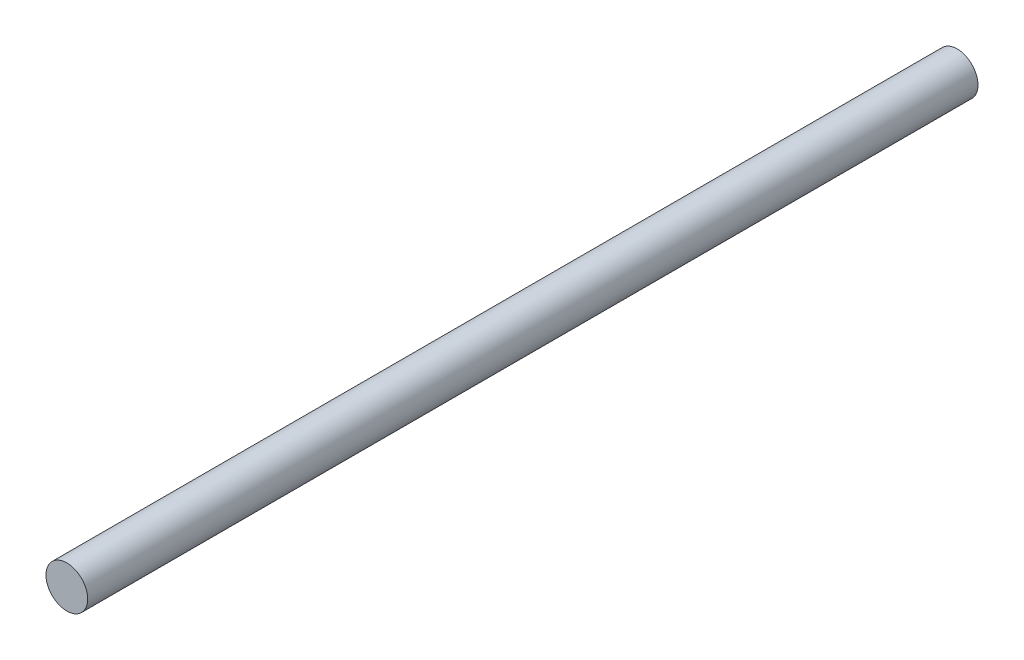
from build123d import *

# Parameters (mm, degrees)
SKETCH2_R           = 1.190625
BOSS_EXTRUDE1_DEPTH = 25.4


with BuildPart() as part:
    # Sketch2 → Boss-Extrude1 (new, symmetric)
    with BuildSketch(Plane.XY):
        Circle(SKETCH2_R)
    extrude(amount=BOSS_EXTRUDE1_DEPTH, both=True)


solid = part.part
